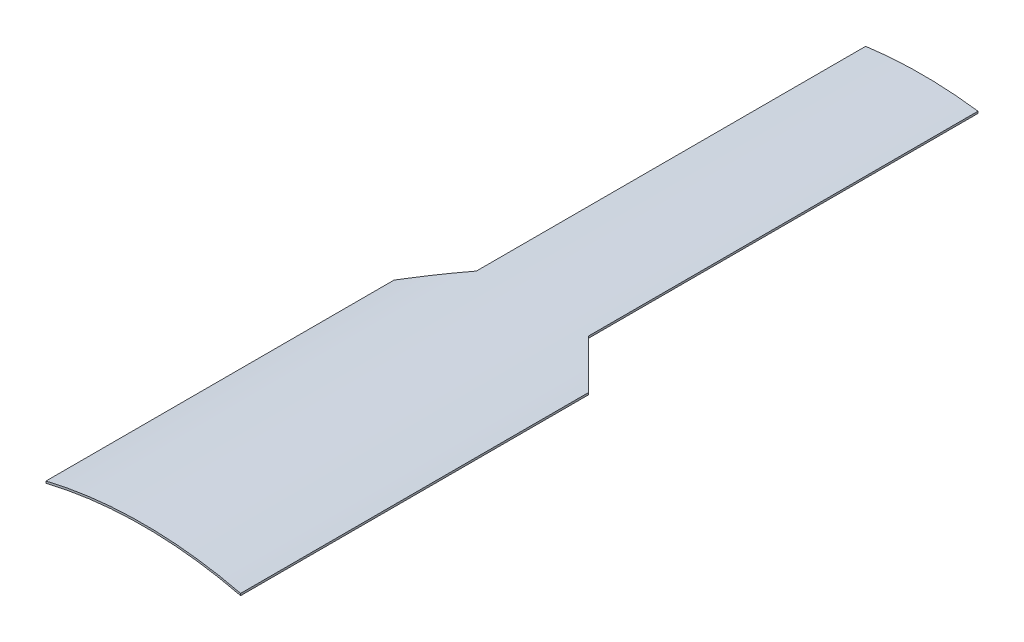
ISO-10303-21;
HEADER;
FILE_DESCRIPTION(('STEP AP214'),'2;1');
FILE_NAME('part.step','',(''),(''),'','','');
FILE_SCHEMA(('AUTOMOTIVE_DESIGN { 1 0 10303 214 1 1 1 1 }'));
ENDSEC;
DATA;
#1=APPLICATION_CONTEXT('core data for automotive mechanical design processes');
#2=APPLICATION_PROTOCOL_DEFINITION('international standard','automotive_design',2000,#1);
#3=PRODUCT_CONTEXT('',#1,'mechanical');
#4=PRODUCT('Part','Part','',(#3));
#5=PRODUCT_RELATED_PRODUCT_CATEGORY('part','',(#4));
#6=PRODUCT_DEFINITION_FORMATION('','',#4);
#7=PRODUCT_DEFINITION_CONTEXT('part definition',#1,'design');
#8=PRODUCT_DEFINITION('design','',#6,#7);
#9=PRODUCT_DEFINITION_SHAPE('','',#8);
#10=(LENGTH_UNIT() NAMED_UNIT(*) SI_UNIT(.MILLI.,.METRE.));
#11=(NAMED_UNIT(*) PLANE_ANGLE_UNIT() SI_UNIT($,.RADIAN.));
#12=(NAMED_UNIT(*) SI_UNIT($,.STERADIAN.) SOLID_ANGLE_UNIT());
#13=UNCERTAINTY_MEASURE_WITH_UNIT(LENGTH_MEASURE(1.E-05),#10,'distance_accuracy_value','');
#14=(GEOMETRIC_REPRESENTATION_CONTEXT(3) GLOBAL_UNCERTAINTY_ASSIGNED_CONTEXT((#13)) GLOBAL_UNIT_ASSIGNED_CONTEXT((#10,
#11,#12)) REPRESENTATION_CONTEXT('',''));
#15=CARTESIAN_POINT('',(0.,0.,0.));
#16=DIRECTION('',(0.,0.,1.));
#17=DIRECTION('',(1.,0.,0.));
#18=AXIS2_PLACEMENT_3D('',#15,#16,#17);
#19=CARTESIAN_POINT('',(0.,0.,50.8));
#20=DIRECTION('',(0.,0.,-1.));
#21=DIRECTION('',(-1.,0.,0.));
#22=AXIS2_PLACEMENT_3D('',#19,#20,#21);
#23=CYLINDRICAL_SURFACE('',#22,26.9875);
#24=DIRECTION('',(0.,0.,-1.));
#25=VECTOR('',#24,1.);
#26=CARTESIAN_POINT('',(3.66541985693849,26.7374242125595,50.8));
#27=LINE('',#26,#25);
#28=CARTESIAN_POINT('',(3.66541985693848,26.7374242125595,0.));
#29=VERTEX_POINT('',#28);
#30=CARTESIAN_POINT('',(3.66541985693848,26.7374242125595,25.4));
#31=VERTEX_POINT('',#30);
#32=EDGE_CURVE('E135',#29,#31,#27,.F.);
#33=ORIENTED_EDGE('',*,*,#32,.F.);
#34=CARTESIAN_POINT('',(0.,0.,0.));
#35=DIRECTION('',(0.,0.,1.));
#36=DIRECTION('',(-1.,0.,0.));
#37=AXIS2_PLACEMENT_3D('',#34,#35,#36);
#38=CIRCLE('',#37,26.9875);
#39=CARTESIAN_POINT('',(-3.66541985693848,26.7374242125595,0.));
#40=VERTEX_POINT('',#39);
#41=EDGE_CURVE('E114',#29,#40,#38,.T.);
#42=ORIENTED_EDGE('',*,*,#41,.T.);
#43=DIRECTION('',(0.,0.,-1.));
#44=VECTOR('',#43,1.);
#45=CARTESIAN_POINT('',(-3.66541985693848,26.7374242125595,50.8));
#46=LINE('',#45,#44);
#47=CARTESIAN_POINT('',(-3.66541985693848,26.7374242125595,25.4));
#48=VERTEX_POINT('',#47);
#49=EDGE_CURVE('E53',#48,#40,#46,.T.);
#50=ORIENTED_EDGE('',*,*,#49,.F.);
#51=CARTESIAN_POINT('',(0.,0.,21.7345801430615));
#52=DIRECTION('',(-0.707106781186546,0.,-0.707106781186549));
#53=DIRECTION('',(0.707106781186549,0.,-0.707106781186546));
#54=AXIS2_PLACEMENT_3D('',#51,#52,#53);
#55=ELLIPSE('',#54,38.1660885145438,26.9875);
#56=CARTESIAN_POINT('',(-6.35,26.2298047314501,28.0845801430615));
#57=VERTEX_POINT('',#56);
#58=EDGE_CURVE('E99',#57,#48,#55,.T.);
#59=ORIENTED_EDGE('',*,*,#58,.F.);
#60=DIRECTION('',(0.,0.,-1.));
#61=VECTOR('',#60,1.);
#62=CARTESIAN_POINT('',(-6.35,26.2298047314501,50.8));
#63=LINE('',#62,#61);
#64=CARTESIAN_POINT('',(-6.35,26.2298047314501,50.8));
#65=VERTEX_POINT('',#64);
#66=EDGE_CURVE('E112',#65,#57,#63,.T.);
#67=ORIENTED_EDGE('',*,*,#66,.F.);
#68=CARTESIAN_POINT('',(0.,0.,50.8));
#69=DIRECTION('',(0.,0.,1.));
#70=DIRECTION('',(-1.,0.,0.));
#71=AXIS2_PLACEMENT_3D('',#68,#69,#70);
#72=CIRCLE('',#71,26.9875);
#73=CARTESIAN_POINT('',(6.35,26.2298047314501,50.8));
#74=VERTEX_POINT('',#73);
#75=EDGE_CURVE('E137',#74,#65,#72,.T.);
#76=ORIENTED_EDGE('',*,*,#75,.F.);
#77=DIRECTION('',(0.,0.,-1.));
#78=VECTOR('',#77,1.);
#79=CARTESIAN_POINT('',(6.35,26.2298047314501,50.8));
#80=LINE('',#79,#78);
#81=CARTESIAN_POINT('',(6.35,26.2298047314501,28.0845801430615));
#82=VERTEX_POINT('',#81);
#83=EDGE_CURVE('E147',#74,#82,#80,.T.);
#84=ORIENTED_EDGE('',*,*,#83,.T.);
#85=CARTESIAN_POINT('',(0.,0.,21.7345801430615));
#86=DIRECTION('',(0.707106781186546,0.,-0.707106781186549));
#87=DIRECTION('',(-0.707106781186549,0.,-0.707106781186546));
#88=AXIS2_PLACEMENT_3D('',#85,#86,#87);
#89=ELLIPSE('',#88,38.1660885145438,26.9875);
#90=EDGE_CURVE('E115',#31,#82,#89,.T.);
#91=ORIENTED_EDGE('',*,*,#90,.F.);
#92=EDGE_LOOP('',(#33,#42,#50,#59,#67,#76,#84,#91));
#93=FACE_BOUND('',#92,.T.);
#94=ADVANCED_FACE('F31',(#93),#23,.T.);
#95=CARTESIAN_POINT('',(-6.35,26.2298047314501,50.8));
#96=DIRECTION('',(1.,0.,0.));
#97=DIRECTION('',(0.,0.,-1.));
#98=AXIS2_PLACEMENT_3D('',#95,#96,#97);
#99=PLANE('',#98);
#100=DIRECTION('',(0.,-1.,0.));
#101=VECTOR('',#100,1.);
#102=CARTESIAN_POINT('',(-6.35,50.8,28.0845801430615));
#103=LINE('',#102,#101);
#104=CARTESIAN_POINT('',(-6.35,26.0991179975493,28.0845801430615));
#105=VERTEX_POINT('',#104);
#106=EDGE_CURVE('E95',#57,#105,#103,.T.);
#107=ORIENTED_EDGE('',*,*,#106,.T.);
#108=DIRECTION('',(0.,0.,-1.));
#109=VECTOR('',#108,1.);
#110=CARTESIAN_POINT('',(-6.35,26.0991179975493,50.8));
#111=LINE('',#110,#109);
#112=CARTESIAN_POINT('',(-6.35,26.0991179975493,50.8));
#113=VERTEX_POINT('',#112);
#114=EDGE_CURVE('E121',#113,#105,#111,.T.);
#115=ORIENTED_EDGE('',*,*,#114,.F.);
#116=DIRECTION('',(0.,-1.,0.));
#117=VECTOR('',#116,1.);
#118=CARTESIAN_POINT('',(-6.35,26.2298047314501,50.8));
#119=LINE('',#118,#117);
#120=EDGE_CURVE('E118',#65,#113,#119,.T.);
#121=ORIENTED_EDGE('',*,*,#120,.F.);
#122=ORIENTED_EDGE('',*,*,#66,.T.);
#123=EDGE_LOOP('',(#107,#115,#121,#122));
#124=FACE_BOUND('',#123,.T.);
#125=ADVANCED_FACE('F117',(#124),#99,.F.);
#126=CARTESIAN_POINT('',(0.,0.,50.8));
#127=DIRECTION('',(0.,0.,-1.));
#128=DIRECTION('',(-1.,0.,0.));
#129=AXIS2_PLACEMENT_3D('',#126,#127,#128);
#130=CYLINDRICAL_SURFACE('',#129,26.8605);
#131=DIRECTION('',(0.,0.,-1.));
#132=VECTOR('',#131,1.);
#133=CARTESIAN_POINT('',(3.66541985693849,26.6092306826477,50.8));
#134=LINE('',#133,#132);
#135=CARTESIAN_POINT('',(3.66541985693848,26.6092306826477,25.4));
#136=VERTEX_POINT('',#135);
#137=CARTESIAN_POINT('',(3.66541985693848,26.6092306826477,0.));
#138=VERTEX_POINT('',#137);
#139=EDGE_CURVE('E45',#136,#138,#134,.T.);
#140=ORIENTED_EDGE('',*,*,#139,.F.);
#141=CARTESIAN_POINT('',(0.,0.,21.7345801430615));
#142=DIRECTION('',(0.707106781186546,0.,-0.707106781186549));
#143=DIRECTION('',(-0.707106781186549,0.,-0.707106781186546));
#144=AXIS2_PLACEMENT_3D('',#141,#142,#143);
#145=ELLIPSE('',#144,37.9864833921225,26.8605);
#146=CARTESIAN_POINT('',(6.35,26.0991179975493,28.0845801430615));
#147=VERTEX_POINT('',#146);
#148=EDGE_CURVE('E160',#147,#136,#145,.F.);
#149=ORIENTED_EDGE('',*,*,#148,.F.);
#150=DIRECTION('',(0.,0.,-1.));
#151=VECTOR('',#150,1.);
#152=CARTESIAN_POINT('',(6.35,26.0991179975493,50.8));
#153=LINE('',#152,#151);
#154=CARTESIAN_POINT('',(6.35,26.0991179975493,50.8));
#155=VERTEX_POINT('',#154);
#156=EDGE_CURVE('E124',#155,#147,#153,.T.);
#157=ORIENTED_EDGE('',*,*,#156,.F.);
#158=CARTESIAN_POINT('',(0.,0.,50.8));
#159=DIRECTION('',(0.,0.,-1.));
#160=DIRECTION('',(1.,0.,0.));
#161=AXIS2_PLACEMENT_3D('',#158,#159,#160);
#162=CIRCLE('',#161,26.8605);
#163=EDGE_CURVE('E143',#113,#155,#162,.T.);
#164=ORIENTED_EDGE('',*,*,#163,.F.);
#165=ORIENTED_EDGE('',*,*,#114,.T.);
#166=CARTESIAN_POINT('',(0.,0.,21.7345801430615));
#167=DIRECTION('',(-0.707106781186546,0.,-0.707106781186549));
#168=DIRECTION('',(0.707106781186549,0.,-0.707106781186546));
#169=AXIS2_PLACEMENT_3D('',#166,#167,#168);
#170=ELLIPSE('',#169,37.9864833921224,26.8605);
#171=CARTESIAN_POINT('',(-3.66541985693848,26.6092306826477,25.4));
#172=VERTEX_POINT('',#171);
#173=EDGE_CURVE('E11',#172,#105,#170,.F.);
#174=ORIENTED_EDGE('',*,*,#173,.F.);
#175=DIRECTION('',(0.,0.,-1.));
#176=VECTOR('',#175,1.);
#177=CARTESIAN_POINT('',(-3.66541985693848,26.6092306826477,50.8));
#178=LINE('',#177,#176);
#179=CARTESIAN_POINT('',(-3.66541985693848,26.6092306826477,0.));
#180=VERTEX_POINT('',#179);
#181=EDGE_CURVE('E164',#180,#172,#178,.F.);
#182=ORIENTED_EDGE('',*,*,#181,.F.);
#183=CARTESIAN_POINT('',(0.,0.,0.));
#184=DIRECTION('',(0.,0.,-1.));
#185=DIRECTION('',(1.,0.,0.));
#186=AXIS2_PLACEMENT_3D('',#183,#184,#185);
#187=CIRCLE('',#186,26.8605);
#188=EDGE_CURVE('E132',#180,#138,#187,.T.);
#189=ORIENTED_EDGE('',*,*,#188,.T.);
#190=EDGE_LOOP('',(#140,#149,#157,#164,#165,#174,#182,#189));
#191=FACE_BOUND('',#190,.T.);
#192=ADVANCED_FACE('F159',(#191),#130,.F.);
#193=CARTESIAN_POINT('',(6.35,26.2298047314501,50.8));
#194=DIRECTION('',(-1.,0.,0.));
#195=DIRECTION('',(0.,0.,1.));
#196=AXIS2_PLACEMENT_3D('',#193,#194,#195);
#197=PLANE('',#196);
#198=DIRECTION('',(0.,-1.,0.));
#199=VECTOR('',#198,1.);
#200=CARTESIAN_POINT('',(6.35,50.8,28.0845801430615));
#201=LINE('',#200,#199);
#202=EDGE_CURVE('E105',#82,#147,#201,.T.);
#203=ORIENTED_EDGE('',*,*,#202,.F.);
#204=ORIENTED_EDGE('',*,*,#83,.F.);
#205=DIRECTION('',(0.,1.,0.));
#206=VECTOR('',#205,1.);
#207=CARTESIAN_POINT('',(6.35,26.2298047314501,50.8));
#208=LINE('',#207,#206);
#209=EDGE_CURVE('E145',#155,#74,#208,.T.);
#210=ORIENTED_EDGE('',*,*,#209,.F.);
#211=ORIENTED_EDGE('',*,*,#156,.T.);
#212=EDGE_LOOP('',(#203,#204,#210,#211));
#213=FACE_BOUND('',#212,.T.);
#214=ADVANCED_FACE('F154',(#213),#197,.F.);
#215=CARTESIAN_POINT('',(0.,0.,0.));
#216=DIRECTION('',(0.,0.,-1.));
#217=DIRECTION('',(-1.,0.,0.));
#218=AXIS2_PLACEMENT_3D('',#215,#216,#217);
#219=PLANE('',#218);
#220=ORIENTED_EDGE('',*,*,#188,.F.);
#221=DIRECTION('',(0.,1.,0.));
#222=VECTOR('',#221,1.);
#223=CARTESIAN_POINT('',(-3.66541985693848,0.,0.));
#224=LINE('',#223,#222);
#225=EDGE_CURVE('E38',#180,#40,#224,.T.);
#226=ORIENTED_EDGE('',*,*,#225,.T.);
#227=ORIENTED_EDGE('',*,*,#41,.F.);
#228=DIRECTION('',(0.,-1.,0.));
#229=VECTOR('',#228,1.);
#230=CARTESIAN_POINT('',(3.66541985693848,0.,0.));
#231=LINE('',#230,#229);
#232=EDGE_CURVE('E120',#29,#138,#231,.T.);
#233=ORIENTED_EDGE('',*,*,#232,.T.);
#234=EDGE_LOOP('',(#220,#226,#227,#233));
#235=FACE_BOUND('',#234,.T.);
#236=ADVANCED_FACE('F130',(#235),#219,.T.);
#237=CARTESIAN_POINT('',(0.,0.,50.8));
#238=DIRECTION('',(0.,0.,-1.));
#239=DIRECTION('',(-1.,0.,0.));
#240=AXIS2_PLACEMENT_3D('',#237,#238,#239);
#241=PLANE('',#240);
#242=ORIENTED_EDGE('',*,*,#75,.T.);
#243=ORIENTED_EDGE('',*,*,#120,.T.);
#244=ORIENTED_EDGE('',*,*,#163,.T.);
#245=ORIENTED_EDGE('',*,*,#209,.T.);
#246=EDGE_LOOP('',(#242,#243,#244,#245));
#247=FACE_BOUND('',#246,.T.);
#248=ADVANCED_FACE('F194',(#247),#241,.F.);
#249=CARTESIAN_POINT('',(3.66541985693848,50.8,0.));
#250=DIRECTION('',(1.,0.,0.));
#251=DIRECTION('',(0.,0.,-1.));
#252=AXIS2_PLACEMENT_3D('',#249,#250,#251);
#253=PLANE('',#252);
#254=ORIENTED_EDGE('',*,*,#32,.T.);
#255=DIRECTION('',(0.,-1.,0.));
#256=VECTOR('',#255,1.);
#257=CARTESIAN_POINT('',(3.66541985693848,50.8,25.4));
#258=LINE('',#257,#256);
#259=EDGE_CURVE('E170',#31,#136,#258,.T.);
#260=ORIENTED_EDGE('',*,*,#259,.T.);
#261=ORIENTED_EDGE('',*,*,#139,.T.);
#262=ORIENTED_EDGE('',*,*,#232,.F.);
#263=EDGE_LOOP('',(#254,#260,#261,#262));
#264=FACE_BOUND('',#263,.T.);
#265=ADVANCED_FACE('F196',(#264),#253,.T.);
#266=CARTESIAN_POINT('',(3.66541985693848,50.8,25.4));
#267=DIRECTION('',(0.707106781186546,0.,-0.707106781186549));
#268=DIRECTION('',(-0.707106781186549,0.,-0.707106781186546));
#269=AXIS2_PLACEMENT_3D('',#266,#267,#268);
#270=PLANE('',#269);
#271=ORIENTED_EDGE('',*,*,#90,.T.);
#272=ORIENTED_EDGE('',*,*,#202,.T.);
#273=ORIENTED_EDGE('',*,*,#148,.T.);
#274=ORIENTED_EDGE('',*,*,#259,.F.);
#275=EDGE_LOOP('',(#271,#272,#273,#274));
#276=FACE_BOUND('',#275,.T.);
#277=ADVANCED_FACE('F179',(#276),#270,.T.);
#278=CARTESIAN_POINT('',(-3.66541985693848,50.8,25.4));
#279=DIRECTION('',(-0.707106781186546,0.,-0.707106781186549));
#280=DIRECTION('',(-0.707106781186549,0.,0.707106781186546));
#281=AXIS2_PLACEMENT_3D('',#278,#279,#280);
#282=PLANE('',#281);
#283=ORIENTED_EDGE('',*,*,#58,.T.);
#284=DIRECTION('',(0.,-1.,0.));
#285=VECTOR('',#284,1.);
#286=CARTESIAN_POINT('',(-3.66541985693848,50.8,25.4));
#287=LINE('',#286,#285);
#288=EDGE_CURVE('E106',#48,#172,#287,.T.);
#289=ORIENTED_EDGE('',*,*,#288,.T.);
#290=ORIENTED_EDGE('',*,*,#173,.T.);
#291=ORIENTED_EDGE('',*,*,#106,.F.);
#292=EDGE_LOOP('',(#283,#289,#290,#291));
#293=FACE_BOUND('',#292,.T.);
#294=ADVANCED_FACE('F97',(#293),#282,.T.);
#295=CARTESIAN_POINT('',(-3.66541985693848,50.8,0.));
#296=DIRECTION('',(-1.,0.,0.));
#297=DIRECTION('',(0.,0.,1.));
#298=AXIS2_PLACEMENT_3D('',#295,#296,#297);
#299=PLANE('',#298);
#300=ORIENTED_EDGE('',*,*,#49,.T.);
#301=ORIENTED_EDGE('',*,*,#225,.F.);
#302=ORIENTED_EDGE('',*,*,#181,.T.);
#303=ORIENTED_EDGE('',*,*,#288,.F.);
#304=EDGE_LOOP('',(#300,#301,#302,#303));
#305=FACE_BOUND('',#304,.T.);
#306=ADVANCED_FACE('F173',(#305),#299,.T.);
#307=CLOSED_SHELL('',(#94,#125,#192,#214,#236,#248,#265,#277,#294,#306));
#308=MANIFOLD_SOLID_BREP('B2',#307);
#309=ADVANCED_BREP_SHAPE_REPRESENTATION('',(#18,#308),#14);
#310=SHAPE_DEFINITION_REPRESENTATION(#9,#309);
ENDSEC;
END-ISO-10303-21;
